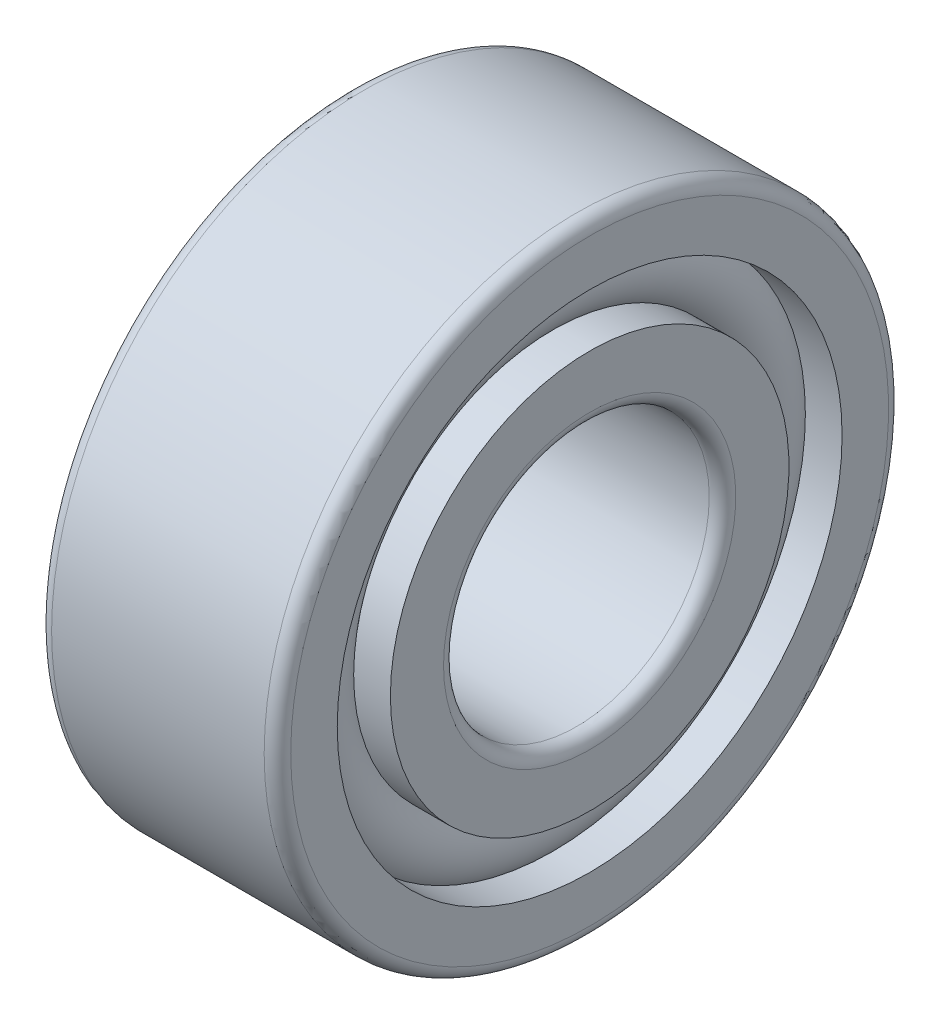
ISO-10303-21;
HEADER;
FILE_DESCRIPTION(('STEP AP214'),'2;1');
FILE_NAME('part.step','',(''),(''),'','','');
FILE_SCHEMA(('AUTOMOTIVE_DESIGN { 1 0 10303 214 1 1 1 1 }'));
ENDSEC;
DATA;
#1=APPLICATION_CONTEXT('core data for automotive mechanical design processes');
#2=APPLICATION_PROTOCOL_DEFINITION('international standard','automotive_design',2000,#1);
#3=PRODUCT_CONTEXT('',#1,'mechanical');
#4=PRODUCT('Part','Part','',(#3));
#5=PRODUCT_RELATED_PRODUCT_CATEGORY('part','',(#4));
#6=PRODUCT_DEFINITION_FORMATION('','',#4);
#7=PRODUCT_DEFINITION_CONTEXT('part definition',#1,'design');
#8=PRODUCT_DEFINITION('design','',#6,#7);
#9=PRODUCT_DEFINITION_SHAPE('','',#8);
#10=(LENGTH_UNIT() NAMED_UNIT(*) SI_UNIT(.MILLI.,.METRE.));
#11=(NAMED_UNIT(*) PLANE_ANGLE_UNIT() SI_UNIT($,.RADIAN.));
#12=(NAMED_UNIT(*) SI_UNIT($,.STERADIAN.) SOLID_ANGLE_UNIT());
#13=UNCERTAINTY_MEASURE_WITH_UNIT(LENGTH_MEASURE(1.E-05),#10,'distance_accuracy_value','');
#14=(GEOMETRIC_REPRESENTATION_CONTEXT(3) GLOBAL_UNCERTAINTY_ASSIGNED_CONTEXT((#13)) GLOBAL_UNIT_ASSIGNED_CONTEXT((#10,
#11,#12)) REPRESENTATION_CONTEXT('',''));
#15=CARTESIAN_POINT('',(0.,0.,0.));
#16=DIRECTION('',(0.,0.,1.));
#17=DIRECTION('',(1.,0.,0.));
#18=AXIS2_PLACEMENT_3D('',#15,#16,#17);
#19=CARTESIAN_POINT('',(-10.1885835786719,0.,0.));
#20=DIRECTION('',(-1.,0.,0.));
#21=DIRECTION('',(0.,0.,1.));
#22=AXIS2_PLACEMENT_3D('',#19,#20,#21);
#23=CYLINDRICAL_SURFACE('',#22,10.);
#24=CARTESIAN_POINT('',(1.,0.,0.));
#25=DIRECTION('',(1.,0.,0.));
#26=DIRECTION('',(0.,0.,-1.));
#27=AXIS2_PLACEMENT_3D('',#24,#25,#26);
#28=CIRCLE('',#27,10.);
#29=CARTESIAN_POINT('',(1.,0.,-10.));
#30=VERTEX_POINT('',#29);
#31=EDGE_CURVE('E56',#30,#30,#28,.F.);
#32=ORIENTED_EDGE('',*,*,#31,.T.);
#33=EDGE_LOOP('',(#32));
#34=FACE_BOUND('',#33,.T.);
#35=CARTESIAN_POINT('',(17.,0.,0.));
#36=DIRECTION('',(-1.,0.,0.));
#37=DIRECTION('',(0.,0.,1.));
#38=AXIS2_PLACEMENT_3D('',#35,#36,#37);
#39=CIRCLE('',#38,10.);
#40=CARTESIAN_POINT('',(17.,0.,10.));
#41=VERTEX_POINT('',#40);
#42=EDGE_CURVE('E59',#41,#41,#39,.F.);
#43=ORIENTED_EDGE('',*,*,#42,.T.);
#44=EDGE_LOOP('',(#43));
#45=FACE_BOUND('',#44,.T.);
#46=ADVANCED_FACE('F30',(#34,#45),#23,.F.);
#47=CARTESIAN_POINT('',(18.,10.,0.));
#48=DIRECTION('',(-1.,0.,0.));
#49=DIRECTION('',(0.,0.,1.));
#50=AXIS2_PLACEMENT_3D('',#47,#48,#49);
#51=PLANE('',#50);
#52=CARTESIAN_POINT('',(18.,0.,0.));
#53=DIRECTION('',(-1.,0.,0.));
#54=DIRECTION('',(0.,0.,1.));
#55=AXIS2_PLACEMENT_3D('',#52,#53,#54);
#56=CIRCLE('',#55,11.);
#57=CARTESIAN_POINT('',(18.,0.,11.));
#58=VERTEX_POINT('',#57);
#59=EDGE_CURVE('E50',#58,#58,#56,.T.);
#60=ORIENTED_EDGE('',*,*,#59,.T.);
#61=EDGE_LOOP('',(#60));
#62=FACE_BOUND('',#61,.T.);
#63=CARTESIAN_POINT('',(18.,0.,0.));
#64=DIRECTION('',(-1.,0.,0.));
#65=DIRECTION('',(0.,0.,1.));
#66=AXIS2_PLACEMENT_3D('',#63,#64,#65);
#67=CIRCLE('',#66,15.);
#68=CARTESIAN_POINT('',(18.,0.,15.));
#69=VERTEX_POINT('',#68);
#70=EDGE_CURVE('E62',#69,#69,#67,.T.);
#71=ORIENTED_EDGE('',*,*,#70,.F.);
#72=EDGE_LOOP('',(#71));
#73=FACE_BOUND('',#72,.T.);
#74=ADVANCED_FACE('F118',(#62,#73),#51,.F.);
#75=CARTESIAN_POINT('',(-10.1885835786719,0.,0.));
#76=DIRECTION('',(-1.,0.,0.));
#77=DIRECTION('',(0.,0.,1.));
#78=AXIS2_PLACEMENT_3D('',#75,#76,#77);
#79=CYLINDRICAL_SURFACE('',#78,15.);
#80=CARTESIAN_POINT('',(15.2360679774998,0.,0.));
#81=DIRECTION('',(-1.,0.,0.));
#82=DIRECTION('',(0.,0.,1.));
#83=AXIS2_PLACEMENT_3D('',#80,#81,#82);
#84=CIRCLE('',#83,15.);
#85=CARTESIAN_POINT('',(15.2360679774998,0.,15.));
#86=VERTEX_POINT('',#85);
#87=EDGE_CURVE('E65',#86,#86,#84,.T.);
#88=ORIENTED_EDGE('',*,*,#87,.F.);
#89=EDGE_LOOP('',(#88));
#90=FACE_BOUND('',#89,.T.);
#91=ORIENTED_EDGE('',*,*,#70,.T.);
#92=EDGE_LOOP('',(#91));
#93=FACE_BOUND('',#92,.T.);
#94=ADVANCED_FACE('F124',(#90,#93),#79,.T.);
#95=CARTESIAN_POINT('',(13.,0.,0.));
#96=DIRECTION('',(-1.,0.,0.));
#97=DIRECTION('',(0.,0.,1.));
#98=AXIS2_PLACEMENT_3D('',#95,#96,#97);
#99=TOROIDAL_SURFACE('',#98,17.,3.);
#100=CARTESIAN_POINT('',(15.2360679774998,0.,0.));
#101=DIRECTION('',(-1.,0.,0.));
#102=DIRECTION('',(0.,0.,1.));
#103=AXIS2_PLACEMENT_3D('',#100,#101,#102);
#104=CIRCLE('',#103,19.);
#105=CARTESIAN_POINT('',(15.2360679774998,0.,19.));
#106=VERTEX_POINT('',#105);
#107=EDGE_CURVE('E68',#106,#106,#104,.T.);
#108=ORIENTED_EDGE('',*,*,#107,.F.);
#109=EDGE_LOOP('',(#108));
#110=FACE_BOUND('',#109,.T.);
#111=ORIENTED_EDGE('',*,*,#87,.T.);
#112=EDGE_LOOP('',(#111));
#113=FACE_BOUND('',#112,.T.);
#114=ADVANCED_FACE('F234',(#110,#113),#99,.T.);
#115=CARTESIAN_POINT('',(-10.1885835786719,0.,0.));
#116=DIRECTION('',(-1.,0.,0.));
#117=DIRECTION('',(0.,0.,1.));
#118=AXIS2_PLACEMENT_3D('',#115,#116,#117);
#119=CYLINDRICAL_SURFACE('',#118,19.);
#120=CARTESIAN_POINT('',(18.,0.,0.));
#121=DIRECTION('',(-1.,0.,0.));
#122=DIRECTION('',(0.,0.,1.));
#123=AXIS2_PLACEMENT_3D('',#120,#121,#122);
#124=CIRCLE('',#123,19.);
#125=CARTESIAN_POINT('',(18.,0.,19.));
#126=VERTEX_POINT('',#125);
#127=EDGE_CURVE('E71',#126,#126,#124,.T.);
#128=ORIENTED_EDGE('',*,*,#127,.F.);
#129=EDGE_LOOP('',(#128));
#130=FACE_BOUND('',#129,.T.);
#131=ORIENTED_EDGE('',*,*,#107,.T.);
#132=EDGE_LOOP('',(#131));
#133=FACE_BOUND('',#132,.T.);
#134=ADVANCED_FACE('F197',(#130,#133),#119,.F.);
#135=CARTESIAN_POINT('',(18.,19.,0.));
#136=DIRECTION('',(-1.,0.,0.));
#137=DIRECTION('',(0.,0.,1.));
#138=AXIS2_PLACEMENT_3D('',#135,#136,#137);
#139=PLANE('',#138);
#140=CARTESIAN_POINT('',(18.,0.,0.));
#141=DIRECTION('',(-1.,0.,0.));
#142=DIRECTION('',(0.,0.,1.));
#143=AXIS2_PLACEMENT_3D('',#140,#141,#142);
#144=CIRCLE('',#143,22.5);
#145=CARTESIAN_POINT('',(18.,0.,22.5));
#146=VERTEX_POINT('',#145);
#147=EDGE_CURVE('E37',#146,#146,#144,.F.);
#148=ORIENTED_EDGE('',*,*,#147,.T.);
#149=EDGE_LOOP('',(#148));
#150=FACE_BOUND('',#149,.T.);
#151=ORIENTED_EDGE('',*,*,#127,.T.);
#152=EDGE_LOOP('',(#151));
#153=FACE_BOUND('',#152,.T.);
#154=ADVANCED_FACE('F114',(#150,#153),#139,.F.);
#155=CARTESIAN_POINT('',(-10.1885835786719,0.,0.));
#156=DIRECTION('',(-1.,0.,0.));
#157=DIRECTION('',(0.,0.,1.));
#158=AXIS2_PLACEMENT_3D('',#155,#156,#157);
#159=CYLINDRICAL_SURFACE('',#158,23.5);
#160=CARTESIAN_POINT('',(17.,0.,0.));
#161=DIRECTION('',(-1.,0.,0.));
#162=DIRECTION('',(0.,0.,1.));
#163=AXIS2_PLACEMENT_3D('',#160,#161,#162);
#164=CIRCLE('',#163,23.5);
#165=CARTESIAN_POINT('',(17.,0.,23.5));
#166=VERTEX_POINT('',#165);
#167=EDGE_CURVE('E41',#166,#166,#164,.T.);
#168=ORIENTED_EDGE('',*,*,#167,.T.);
#169=EDGE_LOOP('',(#168));
#170=FACE_BOUND('',#169,.T.);
#171=CARTESIAN_POINT('',(1.,0.,0.));
#172=DIRECTION('',(1.,0.,0.));
#173=DIRECTION('',(0.,0.,-1.));
#174=AXIS2_PLACEMENT_3D('',#171,#172,#173);
#175=CIRCLE('',#174,23.5);
#176=CARTESIAN_POINT('',(1.,0.,-23.5));
#177=VERTEX_POINT('',#176);
#178=EDGE_CURVE('E45',#177,#177,#175,.T.);
#179=ORIENTED_EDGE('',*,*,#178,.T.);
#180=EDGE_LOOP('',(#179));
#181=FACE_BOUND('',#180,.T.);
#182=ADVANCED_FACE('F109',(#170,#181),#159,.T.);
#183=CARTESIAN_POINT('',(0.,23.5,0.));
#184=DIRECTION('',(1.,0.,0.));
#185=DIRECTION('',(0.,0.,-1.));
#186=AXIS2_PLACEMENT_3D('',#183,#184,#185);
#187=PLANE('',#186);
#188=CARTESIAN_POINT('',(0.,0.,0.));
#189=DIRECTION('',(1.,0.,0.));
#190=DIRECTION('',(0.,0.,-1.));
#191=AXIS2_PLACEMENT_3D('',#188,#189,#190);
#192=CIRCLE('',#191,22.5);
#193=CARTESIAN_POINT('',(0.,0.,-22.5));
#194=VERTEX_POINT('',#193);
#195=EDGE_CURVE('E10',#194,#194,#192,.F.);
#196=ORIENTED_EDGE('',*,*,#195,.T.);
#197=EDGE_LOOP('',(#196));
#198=FACE_BOUND('',#197,.T.);
#199=CARTESIAN_POINT('',(0.,0.,0.));
#200=DIRECTION('',(-1.,0.,0.));
#201=DIRECTION('',(0.,0.,1.));
#202=AXIS2_PLACEMENT_3D('',#199,#200,#201);
#203=CIRCLE('',#202,19.);
#204=CARTESIAN_POINT('',(0.,0.,19.));
#205=VERTEX_POINT('',#204);
#206=EDGE_CURVE('E74',#205,#205,#203,.T.);
#207=ORIENTED_EDGE('',*,*,#206,.F.);
#208=EDGE_LOOP('',(#207));
#209=FACE_BOUND('',#208,.T.);
#210=ADVANCED_FACE('F104',(#198,#209),#187,.F.);
#211=CARTESIAN_POINT('',(-10.1885835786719,0.,0.));
#212=DIRECTION('',(-1.,0.,0.));
#213=DIRECTION('',(0.,0.,1.));
#214=AXIS2_PLACEMENT_3D('',#211,#212,#213);
#215=CYLINDRICAL_SURFACE('',#214,19.);
#216=CARTESIAN_POINT('',(2.76393202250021,0.,0.));
#217=DIRECTION('',(-1.,0.,0.));
#218=DIRECTION('',(0.,0.,1.));
#219=AXIS2_PLACEMENT_3D('',#216,#217,#218);
#220=CIRCLE('',#219,19.);
#221=CARTESIAN_POINT('',(2.76393202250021,0.,19.));
#222=VERTEX_POINT('',#221);
#223=EDGE_CURVE('E77',#222,#222,#220,.T.);
#224=ORIENTED_EDGE('',*,*,#223,.F.);
#225=EDGE_LOOP('',(#224));
#226=FACE_BOUND('',#225,.T.);
#227=ORIENTED_EDGE('',*,*,#206,.T.);
#228=EDGE_LOOP('',(#227));
#229=FACE_BOUND('',#228,.T.);
#230=ADVANCED_FACE('F98',(#226,#229),#215,.F.);
#231=CARTESIAN_POINT('',(5.,0.,0.));
#232=DIRECTION('',(-1.,0.,0.));
#233=DIRECTION('',(0.,0.,1.));
#234=AXIS2_PLACEMENT_3D('',#231,#232,#233);
#235=TOROIDAL_SURFACE('',#234,17.,3.);
#236=CARTESIAN_POINT('',(2.76393202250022,0.,0.));
#237=DIRECTION('',(-1.,0.,0.));
#238=DIRECTION('',(0.,0.,1.));
#239=AXIS2_PLACEMENT_3D('',#236,#237,#238);
#240=CIRCLE('',#239,15.);
#241=CARTESIAN_POINT('',(2.76393202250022,0.,15.));
#242=VERTEX_POINT('',#241);
#243=EDGE_CURVE('E80',#242,#242,#240,.T.);
#244=ORIENTED_EDGE('',*,*,#243,.F.);
#245=EDGE_LOOP('',(#244));
#246=FACE_BOUND('',#245,.T.);
#247=ORIENTED_EDGE('',*,*,#223,.T.);
#248=EDGE_LOOP('',(#247));
#249=FACE_BOUND('',#248,.T.);
#250=ADVANCED_FACE('F92',(#246,#249),#235,.T.);
#251=CARTESIAN_POINT('',(-10.1885835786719,0.,0.));
#252=DIRECTION('',(-1.,0.,0.));
#253=DIRECTION('',(0.,0.,1.));
#254=AXIS2_PLACEMENT_3D('',#251,#252,#253);
#255=CYLINDRICAL_SURFACE('',#254,15.);
#256=CARTESIAN_POINT('',(0.,0.,0.));
#257=DIRECTION('',(-1.,0.,0.));
#258=DIRECTION('',(0.,0.,1.));
#259=AXIS2_PLACEMENT_3D('',#256,#257,#258);
#260=CIRCLE('',#259,15.);
#261=CARTESIAN_POINT('',(0.,0.,15.));
#262=VERTEX_POINT('',#261);
#263=EDGE_CURVE('E83',#262,#262,#260,.T.);
#264=ORIENTED_EDGE('',*,*,#263,.F.);
#265=EDGE_LOOP('',(#264));
#266=FACE_BOUND('',#265,.T.);
#267=ORIENTED_EDGE('',*,*,#243,.T.);
#268=EDGE_LOOP('',(#267));
#269=FACE_BOUND('',#268,.T.);
#270=ADVANCED_FACE('F89',(#266,#269),#255,.T.);
#271=CARTESIAN_POINT('',(0.,10.,0.));
#272=DIRECTION('',(1.,0.,0.));
#273=DIRECTION('',(0.,0.,-1.));
#274=AXIS2_PLACEMENT_3D('',#271,#272,#273);
#275=PLANE('',#274);
#276=CARTESIAN_POINT('',(0.,0.,0.));
#277=DIRECTION('',(1.,0.,0.));
#278=DIRECTION('',(0.,0.,-1.));
#279=AXIS2_PLACEMENT_3D('',#276,#277,#278);
#280=CIRCLE('',#279,11.);
#281=CARTESIAN_POINT('',(0.,0.,-11.));
#282=VERTEX_POINT('',#281);
#283=EDGE_CURVE('E53',#282,#282,#280,.T.);
#284=ORIENTED_EDGE('',*,*,#283,.T.);
#285=EDGE_LOOP('',(#284));
#286=FACE_BOUND('',#285,.T.);
#287=ORIENTED_EDGE('',*,*,#263,.T.);
#288=EDGE_LOOP('',(#287));
#289=FACE_BOUND('',#288,.T.);
#290=ADVANCED_FACE('F87',(#286,#289),#275,.F.);
#291=CARTESIAN_POINT('',(1.,0.,0.));
#292=DIRECTION('',(1.,0.,0.));
#293=DIRECTION('',(0.,0.,-1.));
#294=AXIS2_PLACEMENT_3D('',#291,#292,#293);
#295=TOROIDAL_SURFACE('',#294,11.,1.);
#296=ORIENTED_EDGE('',*,*,#283,.F.);
#297=EDGE_LOOP('',(#296));
#298=FACE_BOUND('',#297,.T.);
#299=ORIENTED_EDGE('',*,*,#31,.F.);
#300=EDGE_LOOP('',(#299));
#301=FACE_BOUND('',#300,.T.);
#302=ADVANCED_FACE('F130',(#298,#301),#295,.T.);
#303=CARTESIAN_POINT('',(17.,0.,0.));
#304=DIRECTION('',(-1.,0.,0.));
#305=DIRECTION('',(0.,0.,1.));
#306=AXIS2_PLACEMENT_3D('',#303,#304,#305);
#307=TOROIDAL_SURFACE('',#306,11.,1.);
#308=ORIENTED_EDGE('',*,*,#42,.F.);
#309=EDGE_LOOP('',(#308));
#310=FACE_BOUND('',#309,.T.);
#311=ORIENTED_EDGE('',*,*,#59,.F.);
#312=EDGE_LOOP('',(#311));
#313=FACE_BOUND('',#312,.T.);
#314=ADVANCED_FACE('F133',(#310,#313),#307,.T.);
#315=CARTESIAN_POINT('',(17.,0.,0.));
#316=DIRECTION('',(-1.,0.,0.));
#317=DIRECTION('',(0.,0.,1.));
#318=AXIS2_PLACEMENT_3D('',#315,#316,#317);
#319=TOROIDAL_SURFACE('',#318,22.5,1.);
#320=ORIENTED_EDGE('',*,*,#147,.F.);
#321=EDGE_LOOP('',(#320));
#322=FACE_BOUND('',#321,.T.);
#323=ORIENTED_EDGE('',*,*,#167,.F.);
#324=EDGE_LOOP('',(#323));
#325=FACE_BOUND('',#324,.T.);
#326=ADVANCED_FACE('F136',(#322,#325),#319,.T.);
#327=CARTESIAN_POINT('',(1.,0.,0.));
#328=DIRECTION('',(1.,0.,0.));
#329=DIRECTION('',(0.,0.,-1.));
#330=AXIS2_PLACEMENT_3D('',#327,#328,#329);
#331=TOROIDAL_SURFACE('',#330,22.5,1.);
#332=ORIENTED_EDGE('',*,*,#178,.F.);
#333=EDGE_LOOP('',(#332));
#334=FACE_BOUND('',#333,.T.);
#335=ORIENTED_EDGE('',*,*,#195,.F.);
#336=EDGE_LOOP('',(#335));
#337=FACE_BOUND('',#336,.T.);
#338=ADVANCED_FACE('F32',(#334,#337),#331,.T.);
#339=CLOSED_SHELL('',(#46,#74,#94,#114,#134,#154,#182,#210,#230,#250,#270,#290,#302,#314,#326,#338));
#340=MANIFOLD_SOLID_BREP('B2',#339);
#341=ADVANCED_BREP_SHAPE_REPRESENTATION('',(#18,#340),#14);
#342=SHAPE_DEFINITION_REPRESENTATION(#9,#341);
ENDSEC;
END-ISO-10303-21;
